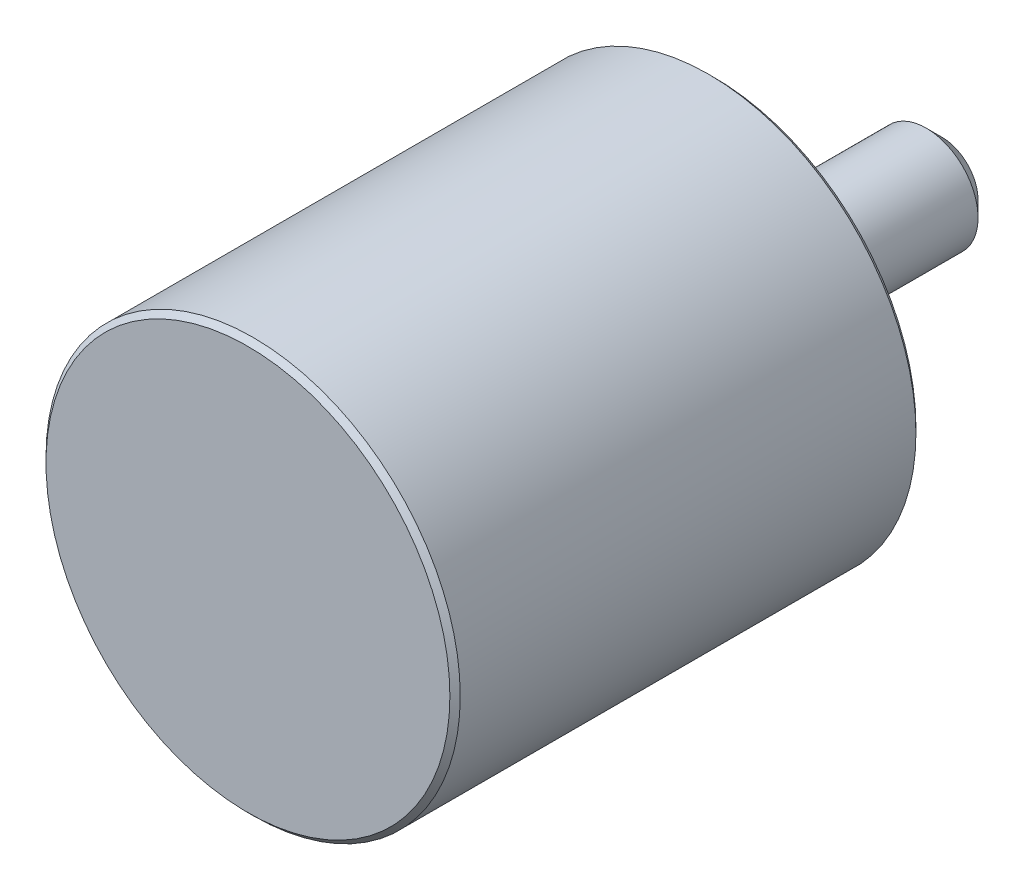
ISO-10303-21;
HEADER;
FILE_DESCRIPTION(('STEP AP214'),'2;1');
FILE_NAME('part.step','',(''),(''),'','','');
FILE_SCHEMA(('AUTOMOTIVE_DESIGN { 1 0 10303 214 1 1 1 1 }'));
ENDSEC;
DATA;
#1=APPLICATION_CONTEXT('core data for automotive mechanical design processes');
#2=APPLICATION_PROTOCOL_DEFINITION('international standard','automotive_design',2000,#1);
#3=PRODUCT_CONTEXT('',#1,'mechanical');
#4=PRODUCT('Part','Part','',(#3));
#5=PRODUCT_RELATED_PRODUCT_CATEGORY('part','',(#4));
#6=PRODUCT_DEFINITION_FORMATION('','',#4);
#7=PRODUCT_DEFINITION_CONTEXT('part definition',#1,'design');
#8=PRODUCT_DEFINITION('design','',#6,#7);
#9=PRODUCT_DEFINITION_SHAPE('','',#8);
#10=(LENGTH_UNIT() NAMED_UNIT(*) SI_UNIT(.MILLI.,.METRE.));
#11=(NAMED_UNIT(*) PLANE_ANGLE_UNIT() SI_UNIT($,.RADIAN.));
#12=(NAMED_UNIT(*) SI_UNIT($,.STERADIAN.) SOLID_ANGLE_UNIT());
#13=UNCERTAINTY_MEASURE_WITH_UNIT(LENGTH_MEASURE(1.E-05),#10,'distance_accuracy_value','');
#14=(GEOMETRIC_REPRESENTATION_CONTEXT(3) GLOBAL_UNCERTAINTY_ASSIGNED_CONTEXT((#13)) GLOBAL_UNIT_ASSIGNED_CONTEXT((#10,
#11,#12)) REPRESENTATION_CONTEXT('',''));
#15=CARTESIAN_POINT('',(0.,0.,0.));
#16=DIRECTION('',(0.,0.,1.));
#17=DIRECTION('',(1.,0.,0.));
#18=AXIS2_PLACEMENT_3D('',#15,#16,#17);
#19=CARTESIAN_POINT('',(0.,0.,0.));
#20=DIRECTION('',(0.,0.,-1.));
#21=DIRECTION('',(-1.,0.,0.));
#22=AXIS2_PLACEMENT_3D('',#19,#20,#21);
#23=PLANE('',#22);
#24=CARTESIAN_POINT('',(0.,0.,0.));
#25=DIRECTION('',(0.,0.,-1.));
#26=DIRECTION('',(-1.,0.,0.));
#27=AXIS2_PLACEMENT_3D('',#24,#25,#26);
#28=CIRCLE('',#27,7.5);
#29=CARTESIAN_POINT('',(-7.5,0.,0.));
#30=VERTEX_POINT('',#29);
#31=EDGE_CURVE('E41',#30,#30,#28,.T.);
#32=ORIENTED_EDGE('',*,*,#31,.T.);
#33=EDGE_LOOP('',(#32));
#34=FACE_BOUND('',#33,.T.);
#35=CARTESIAN_POINT('',(0.,0.,0.));
#36=DIRECTION('',(0.,0.,-1.));
#37=DIRECTION('',(-1.,0.,0.));
#38=AXIS2_PLACEMENT_3D('',#35,#36,#37);
#39=CIRCLE('',#38,5.);
#40=CARTESIAN_POINT('',(-5.,0.,0.));
#41=VERTEX_POINT('',#40);
#42=EDGE_CURVE('E47',#41,#41,#39,.T.);
#43=ORIENTED_EDGE('',*,*,#42,.F.);
#44=EDGE_LOOP('',(#43));
#45=FACE_BOUND('',#44,.T.);
#46=ADVANCED_FACE('F12',(#34,#45),#23,.T.);
#47=CARTESIAN_POINT('',(0.,0.,6.));
#48=DIRECTION('',(0.,0.,-1.));
#49=DIRECTION('',(-1.,0.,0.));
#50=AXIS2_PLACEMENT_3D('',#47,#48,#49);
#51=CYLINDRICAL_SURFACE('',#50,8.);
#52=CARTESIAN_POINT('',(0.,0.,0.500000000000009));
#53=DIRECTION('',(0.,0.,-1.));
#54=DIRECTION('',(-1.,0.,0.));
#55=AXIS2_PLACEMENT_3D('',#52,#53,#54);
#56=CIRCLE('',#55,8.);
#57=CARTESIAN_POINT('',(-8.,0.,0.500000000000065));
#58=VERTEX_POINT('',#57);
#59=EDGE_CURVE('E38',#58,#58,#56,.F.);
#60=ORIENTED_EDGE('',*,*,#59,.T.);
#61=EDGE_LOOP('',(#60));
#62=FACE_BOUND('',#61,.T.);
#63=CARTESIAN_POINT('',(0.,0.,6.));
#64=DIRECTION('',(0.,0.,1.));
#65=DIRECTION('',(1.,0.,0.));
#66=AXIS2_PLACEMENT_3D('',#63,#64,#65);
#67=CIRCLE('',#66,8.);
#68=CARTESIAN_POINT('',(8.00000000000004,0.,5.99999999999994));
#69=VERTEX_POINT('',#68);
#70=EDGE_CURVE('E44',#69,#69,#67,.F.);
#71=ORIENTED_EDGE('',*,*,#70,.T.);
#72=EDGE_LOOP('',(#71));
#73=FACE_BOUND('',#72,.T.);
#74=ADVANCED_FACE('F54',(#62,#73),#51,.T.);
#75=CARTESIAN_POINT('',(3.56131302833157E-13,0.,51.));
#76=DIRECTION('',(0.,0.,-1.));
#77=DIRECTION('',(-1.,0.,0.));
#78=AXIS2_PLACEMENT_3D('',#75,#76,#77);
#79=CYLINDRICAL_SURFACE('',#78,20.);
#80=CARTESIAN_POINT('',(0.,0.,6.5));
#81=DIRECTION('',(0.,0.,1.));
#82=DIRECTION('',(1.,0.,0.));
#83=AXIS2_PLACEMENT_3D('',#80,#81,#82);
#84=CIRCLE('',#83,20.);
#85=CARTESIAN_POINT('',(20.,0.,6.49999999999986));
#86=VERTEX_POINT('',#85);
#87=EDGE_CURVE('E32',#86,#86,#84,.T.);
#88=ORIENTED_EDGE('',*,*,#87,.T.);
#89=EDGE_LOOP('',(#88));
#90=FACE_BOUND('',#89,.T.);
#91=CARTESIAN_POINT('',(3.52639819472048E-13,0.,50.5));
#92=DIRECTION('',(0.,0.,1.));
#93=DIRECTION('',(1.,0.,0.));
#94=AXIS2_PLACEMENT_3D('',#91,#92,#93);
#95=CIRCLE('',#94,20.);
#96=CARTESIAN_POINT('',(20.0000000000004,0.,50.4999999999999));
#97=VERTEX_POINT('',#96);
#98=EDGE_CURVE('E35',#97,#97,#95,.F.);
#99=ORIENTED_EDGE('',*,*,#98,.T.);
#100=EDGE_LOOP('',(#99));
#101=FACE_BOUND('',#100,.T.);
#102=ADVANCED_FACE('F62',(#90,#101),#79,.T.);
#103=CARTESIAN_POINT('',(3.56131302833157E-13,0.,51.));
#104=DIRECTION('',(0.,0.,1.));
#105=DIRECTION('',(1.,0.,0.));
#106=AXIS2_PLACEMENT_3D('',#103,#104,#105);
#107=PLANE('',#106);
#108=CARTESIAN_POINT('',(3.56131302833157E-13,0.,51.));
#109=DIRECTION('',(0.,0.,1.));
#110=DIRECTION('',(1.,0.,0.));
#111=AXIS2_PLACEMENT_3D('',#108,#109,#110);
#112=CIRCLE('',#111,19.5);
#113=CARTESIAN_POINT('',(19.5000000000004,0.,50.9999999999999));
#114=VERTEX_POINT('',#113);
#115=EDGE_CURVE('E23',#114,#114,#112,.T.);
#116=ORIENTED_EDGE('',*,*,#115,.T.);
#117=EDGE_LOOP('',(#116));
#118=FACE_BOUND('',#117,.T.);
#119=ADVANCED_FACE('F88',(#118),#107,.T.);
#120=CARTESIAN_POINT('',(0.,0.,6.));
#121=DIRECTION('',(0.,0.,1.));
#122=DIRECTION('',(1.,0.,0.));
#123=AXIS2_PLACEMENT_3D('',#120,#121,#122);
#124=PLANE('',#123);
#125=CARTESIAN_POINT('',(0.,0.,6.));
#126=DIRECTION('',(0.,0.,1.));
#127=DIRECTION('',(1.,0.,0.));
#128=AXIS2_PLACEMENT_3D('',#125,#126,#127);
#129=CIRCLE('',#128,19.5);
#130=CARTESIAN_POINT('',(19.5,0.,5.99999999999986));
#131=VERTEX_POINT('',#130);
#132=EDGE_CURVE('E27',#131,#131,#129,.F.);
#133=ORIENTED_EDGE('',*,*,#132,.T.);
#134=EDGE_LOOP('',(#133));
#135=FACE_BOUND('',#134,.T.);
#136=ORIENTED_EDGE('',*,*,#70,.F.);
#137=EDGE_LOOP('',(#136));
#138=FACE_BOUND('',#137,.T.);
#139=ADVANCED_FACE('F90',(#135,#138),#124,.F.);
#140=CARTESIAN_POINT('',(-1.117274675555E-13,0.,-16.));
#141=DIRECTION('',(0.,0.,1.));
#142=DIRECTION('',(1.,0.,0.));
#143=AXIS2_PLACEMENT_3D('',#140,#141,#142);
#144=CYLINDRICAL_SURFACE('',#143,5.);
#145=CARTESIAN_POINT('',(-1.01253017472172E-13,0.,-14.5));
#146=DIRECTION('',(0.,0.,-1.));
#147=DIRECTION('',(-1.,0.,0.));
#148=AXIS2_PLACEMENT_3D('',#145,#146,#147);
#149=CIRCLE('',#148,5.);
#150=CARTESIAN_POINT('',(-5.0000000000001,0.,-14.5));
#151=VERTEX_POINT('',#150);
#152=EDGE_CURVE('E8',#151,#151,#149,.F.);
#153=ORIENTED_EDGE('',*,*,#152,.T.);
#154=EDGE_LOOP('',(#153));
#155=FACE_BOUND('',#154,.T.);
#156=ORIENTED_EDGE('',*,*,#42,.T.);
#157=EDGE_LOOP('',(#156));
#158=FACE_BOUND('',#157,.T.);
#159=ADVANCED_FACE('F51',(#155,#158),#144,.T.);
#160=CARTESIAN_POINT('',(-1.117274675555E-13,0.,-16.));
#161=DIRECTION('',(0.,0.,-1.));
#162=DIRECTION('',(-1.,0.,0.));
#163=AXIS2_PLACEMENT_3D('',#160,#161,#162);
#164=PLANE('',#163);
#165=CARTESIAN_POINT('',(-1.117274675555E-13,0.,-16.));
#166=DIRECTION('',(0.,0.,-1.));
#167=DIRECTION('',(-1.,0.,0.));
#168=AXIS2_PLACEMENT_3D('',#165,#166,#167);
#169=CIRCLE('',#168,3.5);
#170=CARTESIAN_POINT('',(-3.50000000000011,0.,-16.));
#171=VERTEX_POINT('',#170);
#172=EDGE_CURVE('E19',#171,#171,#169,.T.);
#173=ORIENTED_EDGE('',*,*,#172,.T.);
#174=EDGE_LOOP('',(#173));
#175=FACE_BOUND('',#174,.T.);
#176=ADVANCED_FACE('F72',(#175),#164,.T.);
#177=CARTESIAN_POINT('',(0.,0.,0.));
#178=DIRECTION('',(0.,0.,1.));
#179=DIRECTION('',(1.,0.,0.));
#180=AXIS2_PLACEMENT_3D('',#177,#178,#179);
#181=CONICAL_SURFACE('',#180,7.5,0.785398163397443);
#182=ORIENTED_EDGE('',*,*,#59,.F.);
#183=EDGE_LOOP('',(#182));
#184=FACE_BOUND('',#183,.T.);
#185=ORIENTED_EDGE('',*,*,#31,.F.);
#186=EDGE_LOOP('',(#185));
#187=FACE_BOUND('',#186,.T.);
#188=ADVANCED_FACE('F68',(#184,#187),#181,.T.);
#189=CARTESIAN_POINT('',(0.,0.,6.5));
#190=DIRECTION('',(0.,0.,1.));
#191=DIRECTION('',(1.,0.,0.));
#192=AXIS2_PLACEMENT_3D('',#189,#190,#191);
#193=CONICAL_SURFACE('',#192,20.,0.785398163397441);
#194=ORIENTED_EDGE('',*,*,#132,.F.);
#195=EDGE_LOOP('',(#194));
#196=FACE_BOUND('',#195,.T.);
#197=ORIENTED_EDGE('',*,*,#87,.F.);
#198=EDGE_LOOP('',(#197));
#199=FACE_BOUND('',#198,.T.);
#200=ADVANCED_FACE('F71',(#196,#199),#193,.T.);
#201=CARTESIAN_POINT('',(3.56131302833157E-13,0.,51.));
#202=DIRECTION('',(0.,0.,-1.));
#203=DIRECTION('',(-1.,0.,0.));
#204=AXIS2_PLACEMENT_3D('',#201,#202,#203);
#205=CONICAL_SURFACE('',#204,19.5,0.785398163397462);
#206=ORIENTED_EDGE('',*,*,#98,.F.);
#207=EDGE_LOOP('',(#206));
#208=FACE_BOUND('',#207,.T.);
#209=ORIENTED_EDGE('',*,*,#115,.F.);
#210=EDGE_LOOP('',(#209));
#211=FACE_BOUND('',#210,.T.);
#212=ADVANCED_FACE('F75',(#208,#211),#205,.T.);
#213=CARTESIAN_POINT('',(-1.117274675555E-13,0.,-16.));
#214=DIRECTION('',(0.,0.,1.));
#215=DIRECTION('',(1.,0.,0.));
#216=AXIS2_PLACEMENT_3D('',#213,#214,#215);
#217=CONICAL_SURFACE('',#216,3.5,0.785398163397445);
#218=ORIENTED_EDGE('',*,*,#152,.F.);
#219=EDGE_LOOP('',(#218));
#220=FACE_BOUND('',#219,.T.);
#221=ORIENTED_EDGE('',*,*,#172,.F.);
#222=EDGE_LOOP('',(#221));
#223=FACE_BOUND('',#222,.T.);
#224=ADVANCED_FACE('F14',(#220,#223),#217,.T.);
#225=CLOSED_SHELL('',(#46,#74,#102,#119,#139,#159,#176,#188,#200,#212,#224));
#226=MANIFOLD_SOLID_BREP('B1',#225);
#227=ADVANCED_BREP_SHAPE_REPRESENTATION('',(#18,#226),#14);
#228=SHAPE_DEFINITION_REPRESENTATION(#9,#227);
ENDSEC;
END-ISO-10303-21;
